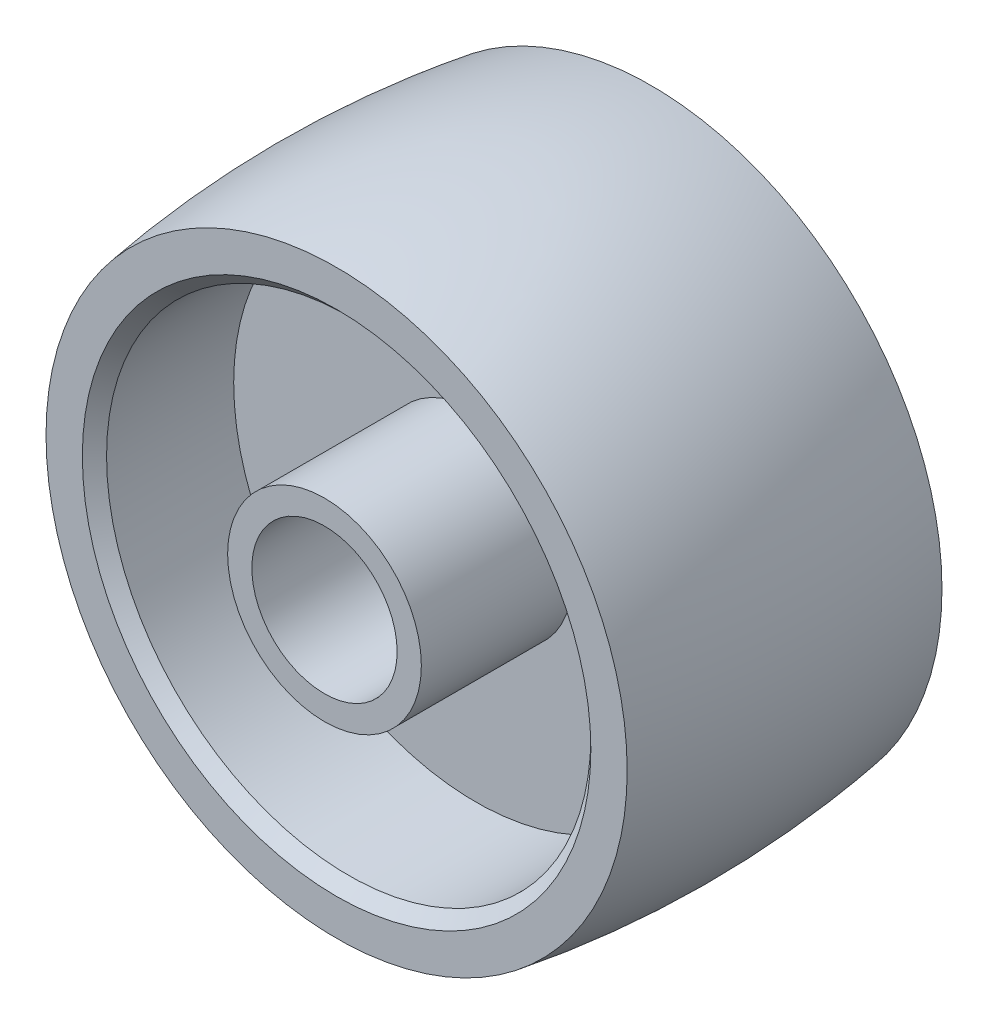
from build123d import *


with BuildPart() as part:
    # Esquisse1 → R_volution1 (revolve)
    with BuildSketch(Plane(origin=(0, 0, 0), x_dir=(0, 0, -1), z_dir=(1, 0, 0)), mode=Mode.PRIVATE) as r_volution1_sk:
        with BuildLine():
            Line((7, 3), (-7, 3))
            Line((-7, 3), (-7, 4))
            Line((-7, 4), (-0.75, 4))
            Line((-0.75, 4), (-0.75, 10))
            Line((-0.75, 10), (-6, 10))
            Line((-6, 10), (-6.5, 10.5))
            Line((-6.5, 10.5), (-6.5, 12))
            ThreePointArc((-6.5, 12), (0, 12.5), (6.5, 12))
            Line((6.5, 12), (6.5, 10.5))
            Line((6.5, 10.5), (6, 10))
            Line((6, 10), (0.75, 10))
            Line((0.75, 10), (0.75, 4))
            Line((0.75, 4), (7, 4))
            Line((7, 4), (7, 3))
        make_face()
    revolve(r_volution1_sk.sketch.rotate(Axis((0, 0, 4.7147115), (0, 0, -1)), 90), axis=Axis((0, 0, 4.7147115), (0, 0, -1)))


solid = part.part
